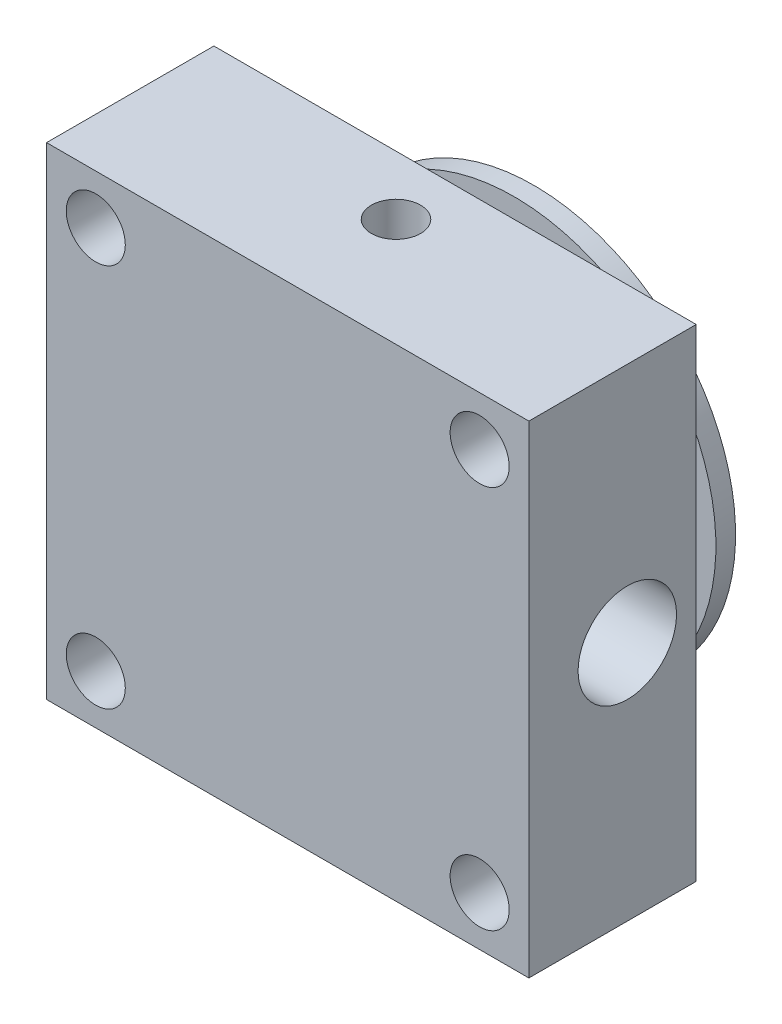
from build123d import *

# Parameters (mm, degrees)
ESQUISSE1_W             = 49
ESQUISSE1_H             = 49
BASE_EXTRUSION_DEPTH    = 17
ESQUISSE2_R             = 20.5
BOSS_EXTRU_1_DEPTH      = 8
ESQUISSE3_R             = 3
ENL_V_MAT_EXTRU_2_DEPTH = 74.668174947
ESQUISSE4_R             = 22
ESQUISSE4_R_2           = 17.5
ENL_V_MAT_EXTRU_3_DEPTH = 4
ENL_V_MAT_EXTRU_4_REACH = 73.351
ESQUISSE8_R             = 2.5


with BuildPart() as part:
    # Esquisse1 → Base-Extrusion (new body)
    with BuildSketch(Plane.XY):
        with Locations((-24.5, 24.5)):
            Rectangle(ESQUISSE1_W, ESQUISSE1_H)
    extrude(amount=BASE_EXTRUSION_DEPTH)

    # Esquisse2 → Boss.-Extru.1 (add)
    with BuildSketch(Plane(origin=(0, 0, 0), x_dir=(-1, 0, 0), z_dir=(0, 0, -1))):
        with Locations((24.5, 24.5)):
            Circle(ESQUISSE2_R)
    extrude(amount=BOSS_EXTRU_1_DEPTH)

    # Esquisse3 → Enl_v. mat.-Extru.2 (cut, through all)
    with BuildSketch(Plane.XY.offset(17)):
        with Locations((-44, 44)):
            Circle(ESQUISSE3_R)
        with Locations((-5, 44)):
            Circle(ESQUISSE3_R)
        with Locations((-44, 5)):
            Circle(ESQUISSE3_R)
        with Locations((-5, 5)):
            Circle(ESQUISSE3_R)
    extrude(amount=-ENL_V_MAT_EXTRU_2_DEPTH, mode=Mode.SUBTRACT)

    # Esquisse4 → Enl_v. mat.-Extru.3 (cut)
    with BuildSketch(Plane(origin=(0, 0, -6), x_dir=(-1, 0, 0), z_dir=(0, 0, -1))):
        with Locations((24.5, 24.5)):
            Circle(ESQUISSE4_R)
        with Locations((24.5, 24.5)):
            Circle(ESQUISSE4_R_2, mode=Mode.SUBTRACT)
    extrude(amount=-ENL_V_MAT_EXTRU_3_DEPTH, mode=Mode.SUBTRACT)

    # Esquisse5 → Enlever de la mati_re-Pivoter1 (revolve, cut)
    with BuildSketch(Plane.XY.offset(7), mode=Mode.PRIVATE) as enlever_de_la_mati_re_pivoter1_sk:
        Polygon((10, 29.5), (-10, 29.5), (-12.886751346, 24.5), (10, 24.5), align=None)
    revolve(enlever_de_la_mati_re_pivoter1_sk.sketch.rotate(Axis((-17.553981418, 24.5, 7), (1, 0, 0)), 90), axis=Axis((-17.553981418, 24.5, 7), (1, 0, 0)), mode=Mode.SUBTRACT)

    # Esquisse6 → Enlever de la mati_re-Pivoter2 (revolve, cut)
    with BuildSketch(Plane.XY.offset(7), mode=Mode.PRIVATE) as enlever_de_la_mati_re_pivoter2_sk:
        Polygon((-60, 29.5), (-39, 29.5), (-36.113248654, 24.5), (-60, 24.5), align=None)
    revolve(enlever_de_la_mati_re_pivoter2_sk.sketch.rotate(Axis((-69.687962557, 24.5, 7), (1, 0, 0)), 90), axis=Axis((-69.687962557, 24.5, 7), (1, 0, 0)), mode=Mode.SUBTRACT)

    # Esquisse7 → Enlever de la mati_re-Pivoter3 (revolve, cut)
    with BuildSketch(Plane(origin=(0, 24.5, 0), x_dir=(-1, 0, 0), z_dir=(0, 1, 0))):
        Polygon((11.5, -10), (11.5, -2), (19.5, -2), (19.5, 10), (24.5, 12.886751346), (24.5, -10), align=None)
    revolve(axis=Axis((-24.5, 24.5, 20.173400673), (0, 0, -1)), mode=Mode.SUBTRACT)

    # Esquisse8 → Enl_v. mat.-Extru.4 (cut, up to next)
    with BuildSketch(Plane(origin=(0, 49, 0), x_dir=(-1, 0, 0), z_dir=(0, 1, 0)), mode=Mode.PRIVATE) as enl_v_mat_extru_4_sk1:
        with Locations(Location((24.5, 6, 0), (0, 0, 90))):
            Circle(ESQUISSE8_R)
    enl_v_mat_extru_4_tool1 = extrude(enl_v_mat_extru_4_sk1.sketch, amount=-ENL_V_MAT_EXTRU_4_REACH, mode=Mode.PRIVATE) & part.part
    add(enl_v_mat_extru_4_tool1.solids().sort_by_distance((-24.5, 49, 6))[0], mode=Mode.SUBTRACT)


solid = part.part
